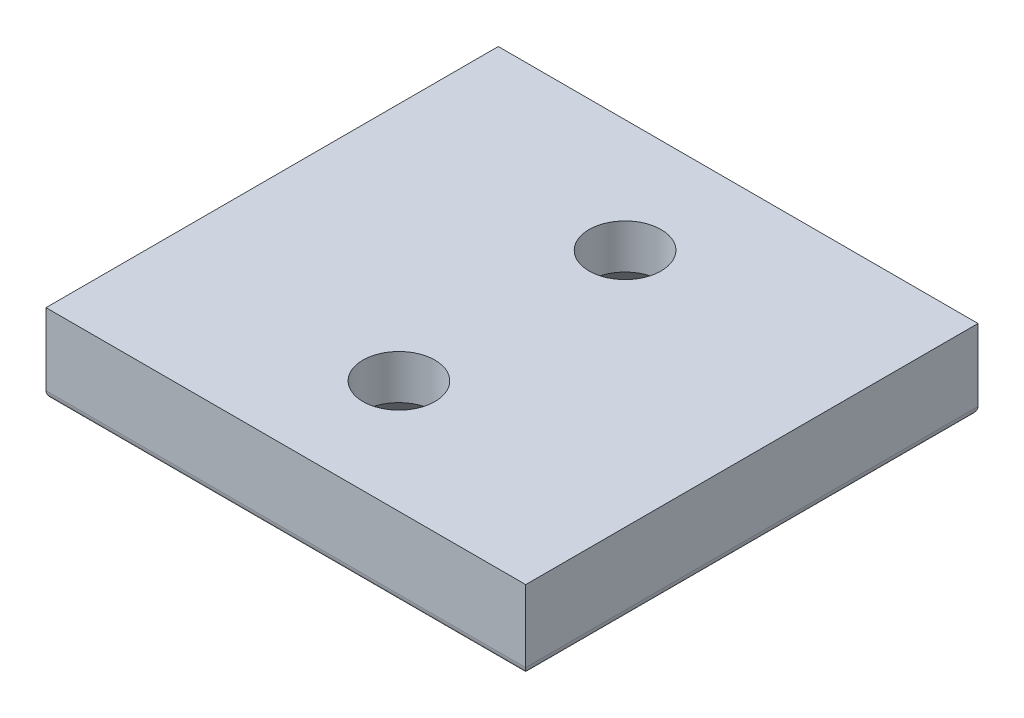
from build123d import *

# Parameters (mm, degrees)
SKETCH1_W                                            = 60
SKETCH1_H                                            = 56.57
BOSS_EXTRUDE1_DEPTH                                  = 10
FILLET1_R                                            = 1
CSK_FOR_M8_HEX_SOCKET_COUNTERSUNK_CAP_SC_D           = 9
CSK_FOR_M8_HEX_SOCKET_COUNTERSUNK_CAP_SC_CSINK_D     = 17.92
CSK_FOR_M8_HEX_SOCKET_COUNTERSUNK_CAP_SC_CSINK_ANGLE = 90


with BuildPart() as part:
    # Sketch1 → Boss-Extrude1 (new body)
    with BuildSketch(Plane(origin=(0, 0, 0), x_dir=(1, 0, 0), z_dir=(0, 1, 0))):
        Rectangle(SKETCH1_W, SKETCH1_H)
    extrude(amount=BOSS_EXTRUDE1_DEPTH)

    # Fillet1
    fillet1_edges = [part.edges().sort_by_distance(p)[0] for p in [
        (0, 0, 28.285),
        (-30, 0, 0),
        (0, 0, -28.285),
        (30, 0, 0),
    ]]
    fillet(fillet1_edges, radius=FILLET1_R)

    # CSK for M8 Hex Socket Countersunk Cap Sc (through all)
    with Locations(Plane(origin=(0, 0, 0), x_dir=(-1, 0, 0), z_dir=(0, -1, 0))):
        with Locations((0, -14.1425), (0, 14.1425)):
            CounterSinkHole(CSK_FOR_M8_HEX_SOCKET_COUNTERSUNK_CAP_SC_D / 2, CSK_FOR_M8_HEX_SOCKET_COUNTERSUNK_CAP_SC_CSINK_D / 2, counter_sink_angle=CSK_FOR_M8_HEX_SOCKET_COUNTERSUNK_CAP_SC_CSINK_ANGLE)


solid = part.part
